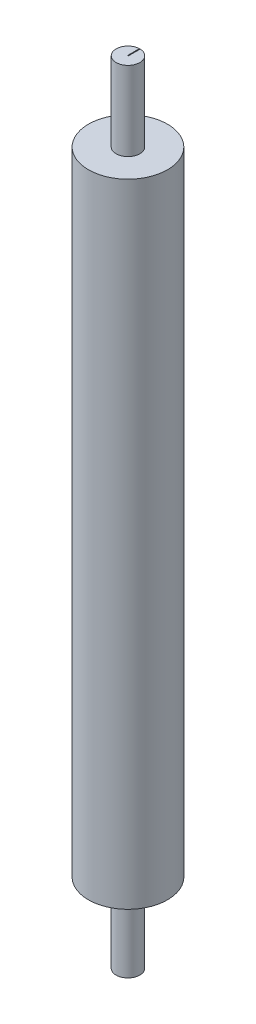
from build123d import *

# Parameters (mm, degrees)
CROQUIS1_R                   = 25
SALIENTE_EXTRUIR2_DEPTH      = 400
CROQUIS3_R                   = 7.5
SALIENTE_EXTRUIR3_DEPTH      = 40
CROQUIS4_R                   = 7.5
SALIENTE_EXTRUIR4_DEPTH      = 50
SALIENTE_EXTRUIR6_START      = 50
CROQUIS5_R                   = 7.5
SALIENTE_EXTRUIR6_DEPTH      = 50
CROQUIS6_W                   = 0.5
CROQUIS6_H                   = 7.5
CORTAR_EXTRUIR_L_MINA1_DEPTH = 0.5


with BuildPart() as part:
    # Croquis1 → Saliente-Extruir2 (new body)
    with BuildSketch(Plane(origin=(0, 0, 0), x_dir=(1, 0, 0), z_dir=(0, 1, 0))):
        with Locations(Location((0, 0, 0), (0, 0, 270))):
            Circle(CROQUIS1_R)
    extrude(amount=SALIENTE_EXTRUIR2_DEPTH)

    # Croquis3 → Saliente-Extruir3 (add)
    with BuildSketch(Plane(origin=(0, 0, 0), x_dir=(1, 0, 0), z_dir=(0, 1, 0))):
        with Locations(Location((0, 0, 0), (0, 0, 270))):
            Circle(CROQUIS3_R)
    extrude(amount=-SALIENTE_EXTRUIR3_DEPTH)

    # Croquis4 → Saliente-Extruir4 (add)
    with BuildSketch(Plane(origin=(0, 0, 0), x_dir=(1, 0, 0), z_dir=(0, 1, 0))):
        with Locations(Location((0, 0, 0), (0, 0, 270))):
            Circle(CROQUIS4_R)
    extrude(amount=-SALIENTE_EXTRUIR4_DEPTH)

    # Croquis5 → Saliente-Extruir6 (add)
    with BuildSketch(Plane(origin=(0, 400, 0), x_dir=(1, 0, 0), z_dir=(0, 1, 0)).offset(SALIENTE_EXTRUIR6_START)):
        with Locations(Location((0, 0, 0), (0, 0, 270))):
            Circle(CROQUIS5_R)
    extrude(amount=-SALIENTE_EXTRUIR6_DEPTH)

    # Croquis6 → Cortar-Extruir-L_mina1 (cut)
    with BuildSketch(Plane(origin=(0, 450, 0), x_dir=(1, 0, 0), z_dir=(0, 1, 0))):
        with Locations((0, 3.75)):
            Rectangle(CROQUIS6_W, CROQUIS6_H)
    extrude(amount=-CORTAR_EXTRUIR_L_MINA1_DEPTH, mode=Mode.SUBTRACT)


solid = part.part
